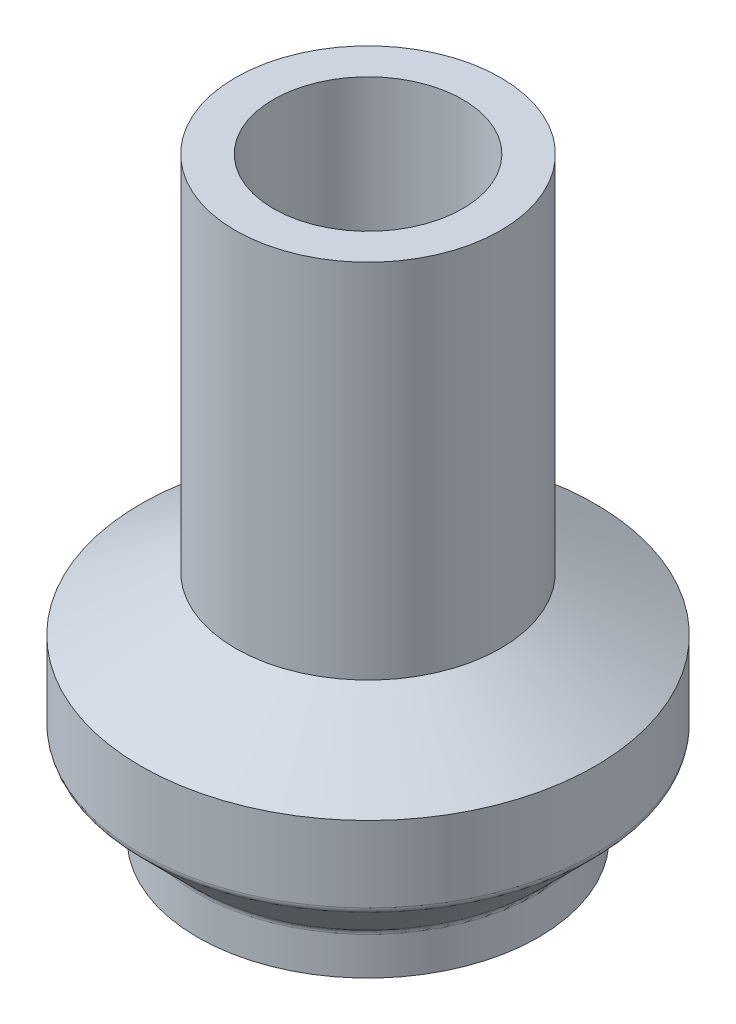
from build123d import *

# Parameters (mm, degrees)
ESQUISSE2_R             = 0.5
ENL_V_MAT_EXTRU_1_DEPTH = 16.733713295


with BuildPart() as part:
    # Esquisse1 → R_volution1 (revolve)
    with BuildSketch(Plane.XY, mode=Mode.PRIVATE) as r_volution1_sk:
        with BuildLine():
            Line((-0.610971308, 19.28535702), (0.389028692, 19.28535702))
            Line((0.389028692, 19.28535702), (0.389028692, 23.28535702))
            Line((0.389028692, 23.28535702), (0.889028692, 23.28535702))
            Line((0.889028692, 23.28535702), (0.889028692, 19.28535702))
            Line((0.889028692, 19.28535702), (3.889028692, 19.28535702))
            Line((3.889028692, 19.28535702), (3.889028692, 29.951042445))
            Line((3.889028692, 29.951042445), (1.389028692, 29.951042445))
            Line((1.389028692, 29.951042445), (1.389028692, 34.951042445))
            Line((1.389028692, 34.951042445), (0.389028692, 34.951042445))
            Line((0.389028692, 34.951042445), (0.389028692, 25.394418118))
            Line((0.389028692, 25.394418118), (-2.110971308, 23.951042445))
            Line((-2.110971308, 23.951042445), (-2.110971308, 21.951042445))
            ThreePointArc((-2.110971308, 21.951042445), (-2.095747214, 21.874505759), (-2.052392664, 21.809621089))
            Line((-2.052392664, 21.809621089), (-0.669549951, 20.426778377))
            ThreePointArc((-0.669549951, 20.426778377), (-0.626195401, 20.361893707), (-0.610971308, 20.28535702))
            Line((-0.610971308, 20.28535702), (-0.610971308, 19.28535702))
        make_face()
    revolve(r_volution1_sk.sketch.rotate(Axis((3.889028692, 35.234293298, 0), (0, -1, 0)), 270), axis=Axis((3.889028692, 35.234293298, 0), (0, -1, 0)))

    # Esquisse2 → Enl_v. mat.-Extru.1 (cut, through all)
    with BuildSketch(Plane(origin=(0, 29.951042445, 0), x_dir=(-1, 0, 0), z_dir=(0, 1, 0))):
        with Locations(Location((-3.876615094, -1.5, 0), (0, 0, 90))):
            Circle(ESQUISSE2_R)
        with Locations(Location((-3.876615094, 1.5, 0), (0, 0, 90))):
            Circle(ESQUISSE2_R)
    extrude(amount=-ENL_V_MAT_EXTRU_1_DEPTH, mode=Mode.SUBTRACT)


solid = part.part
